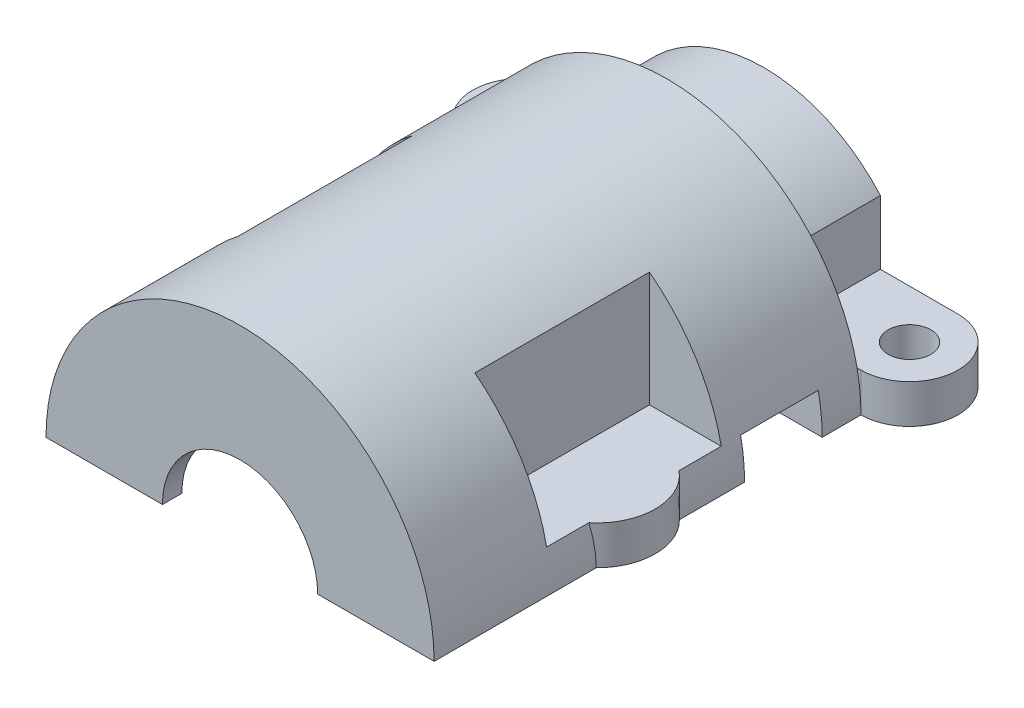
from build123d import *

# Parameters (mm, degrees)
SKETCH1_R               = 12.7
BOSS_EXTRUDE1_DEPTH     = 34.29
SKETCH2_W               = 25.4
SKETCH2_H               = 14.553521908
CUT_EXTRUDE1_DEPTH      = 39.708966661
CUT_EXTRUDE2_START      = -2.54
SKETCH5_W               = 6.454347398
SKETCH5_H               = 11.43
CUT_EXTRUDE2_DEPTH      = 37.168966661
CUT_EXTRUDE3_DEPTH      = 39.708966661
CUT_EXTRUDE3_DEPTH_BACK = 39.708966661
SKETCH6_W               = 5.08
SKETCH6_H               = 2.54
BOSS_EXTRUDE2_REACH     = 40.709
SKETCH7_W               = 6.35
SKETCH7_H               = 8.89
CUT_EXTRUDE5_DEPTH      = 6.35
SKETCH10_W              = 2.217377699
SKETCH10_H              = 5.114348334
CUT_EXTRUDE6_DEPTH      = 6.35
BOSS_EXTRUDE4_DEPTH     = 2.54
SKETCH14_R              = 1.397
CUT_EXTRUDE8_DEPTH      = 40.128574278
SKETCH17_R              = 3.81
BOSS_EXTRUDE5_DEPTH     = 2.54


with BuildPart() as part:
    # Sketch1 → Boss-Extrude1 (new body)
    with BuildSketch(Plane.XY):
        Circle(SKETCH1_R)
    extrude(amount=BOSS_EXTRUDE1_DEPTH)

    # Sketch2 → Cut-Extrude1 (cut, through all)
    with BuildSketch(Plane.XY.offset(34.29)):
        with Locations((0, -7.276760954)):
            Rectangle(SKETCH2_W, SKETCH2_H)
    extrude(amount=-CUT_EXTRUDE1_DEPTH, mode=Mode.SUBTRACT)

    # Sketch3 → Cut-Revolve1 (revolve, cut)
    with BuildSketch(Plane.XZ):
        Polygon((5.08, 34.29), (5.08, 33.02), (7.9375, 33.02), (7.9375, 27.94), (5.207, 27.94), (5.207, 13.97), (9.525, 13.97), (9.525, 8.89), (8.128, 8.89), (8.128, 0), (0, 0), (0, 34.29), align=None)
    revolve(axis=Axis((0, 0, -2.016739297), (0, 0, 1)), mode=Mode.SUBTRACT)

    # Sketch5 → Cut-Extrude2 (cut, through all)
    with BuildSketch(Plane(origin=(0, 0, 0), x_dir=(-1, 0, 0), z_dir=(0, -1, 0)).offset(CUT_EXTRUDE2_START)):
        with Locations((10.974173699, -20.955)):
            Rectangle(SKETCH5_W, SKETCH5_H)
        with Locations((-10.974173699, -20.955)):
            Rectangle(SKETCH5_W, SKETCH5_H)
    extrude(amount=-CUT_EXTRUDE2_DEPTH, mode=Mode.SUBTRACT)

    # Sketch6 → Cut-Extrude3 (cut, two sides: drawn at the far end of the back side and taken through both)
    with BuildSketch(Plane(origin=(0, 0, 0), x_dir=(0, 0, -1), z_dir=(1, 0, 0)).offset(-CUT_EXTRUDE3_DEPTH_BACK)):
        with Locations((-11.43, 1.27)):
            Rectangle(SKETCH6_W, SKETCH6_H)
    extrude(amount=CUT_EXTRUDE3_DEPTH + CUT_EXTRUDE3_DEPTH_BACK, mode=Mode.SUBTRACT)

    # Sketch7 → Boss-Extrude2 (add, up to next)
    with BuildSketch(Plane(origin=(0, 0, 0), x_dir=(-1, 0, 0), z_dir=(0, -1, 0)), mode=Mode.PRIVATE) as boss_extrude2_sk1:
        with Locations((-9.525, -4.445)):
            Rectangle(SKETCH7_W, SKETCH7_H)
    boss_extrude2_tool1 = extrude(boss_extrude2_sk1.sketch, amount=-BOSS_EXTRUDE2_REACH, mode=Mode.PRIVATE) - part.part
    # Sketch7 → Boss-Extrude2 (add, up to next)
    with BuildSketch(Plane(origin=(0, 0, 0), x_dir=(-1, 0, 0), z_dir=(0, -1, 0)), mode=Mode.PRIVATE) as boss_extrude2_sk2:
        with Locations((9.525, -4.445)):
            Rectangle(SKETCH7_W, SKETCH7_H)
    boss_extrude2_tool2 = extrude(boss_extrude2_sk2.sketch, amount=-BOSS_EXTRUDE2_REACH, mode=Mode.PRIVATE) - part.part
    add(boss_extrude2_tool1.solids().sort_by_distance((9.525, 0, 4.445))[0])
    add(boss_extrude2_tool2.solids().sort_by_distance((-9.525, 0, 4.445))[0])

    # Sketch8 → Cut-Extrude5 (cut)
    with BuildSketch(Plane(origin=(0, 0, 0), x_dir=(-1, 0, 0), z_dir=(0, 0, -1))):
        with BuildLine():
            Line((12.443407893, 2.54), (9.837377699, 2.54))
            ThreePointArc((9.837377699, 2.54), (0, 10.16), (-9.837377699, 2.54))
            Line((-9.837377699, 2.54), (-12.443407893, 2.54))
            ThreePointArc((-12.443407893, 2.54), (0, 12.7), (12.443407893, 2.54))
        make_face()
    extrude(amount=-CUT_EXTRUDE5_DEPTH, mode=Mode.SUBTRACT)

    # Sketch10 → Cut-Extrude6 (cut)
    with BuildSketch(Plane(origin=(0, 0, 0), x_dir=(-1, 0, 0), z_dir=(0, 0, -1))):
        with Locations((-8.72868885, 5.097174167)):
            Rectangle(SKETCH10_W, SKETCH10_H)
        with Locations((8.72868885, 5.097174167)):
            Rectangle(SKETCH10_W, SKETCH10_H)
    extrude(amount=-CUT_EXTRUDE6_DEPTH, mode=Mode.SUBTRACT)

    # Sketch13 → Boss-Extrude4 (add)
    with BuildSketch(Plane(origin=(0, 2.54, 0), x_dir=(1, 0, 0), z_dir=(0, 1, 0))):
        with BuildLine():
            Line((-12.7, 0), (-9.210470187, 0))
            Line((-9.210470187, 0), (-9.210470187, -6.35))
            Line((-9.210470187, -6.35), (-12.7, -6.35))
            ThreePointArc((-12.7, -6.35), (-15.875, -3.175), (-12.7, 0))
        make_face()
        with BuildLine():
            Line((10.15064463, 0), (10.15064463, -6.35))
            Line((10.15064463, -6.35), (12.7, -6.35))
            ThreePointArc((12.7, -6.35), (15.875, -3.175), (12.7, 0))
            Line((12.7, 0), (10.15064463, 0))
        make_face()
    extrude(amount=-BOSS_EXTRUDE4_DEPTH)

    # Sketch14 → Cut-Extrude8 (cut, through all)
    with BuildSketch(Plane(origin=(0, 2.54, 0), x_dir=(1, 0, 0), z_dir=(0, 1, 0))):
        with Locations(Location((-12.7, -3.175, 0), (0, 0, 180))):
            Circle(SKETCH14_R)
        with Locations(Location((12.7, -3.175, 0), (0, 0, 180))):
            Circle(SKETCH14_R)
    extrude(amount=-CUT_EXTRUDE8_DEPTH, mode=Mode.SUBTRACT)

    # Sketch17 → Boss-Extrude5 (add)
    with BuildSketch(Plane(origin=(0, 2.54, 0), x_dir=(1, 0, 0), z_dir=(0, 1, 0))):
        with Locations((-10.033, -20.955)):
            Circle(SKETCH17_R)
        with Locations((10.033, -20.955)):
            Circle(SKETCH17_R)
    extrude(amount=-BOSS_EXTRUDE5_DEPTH)


solid = part.part
